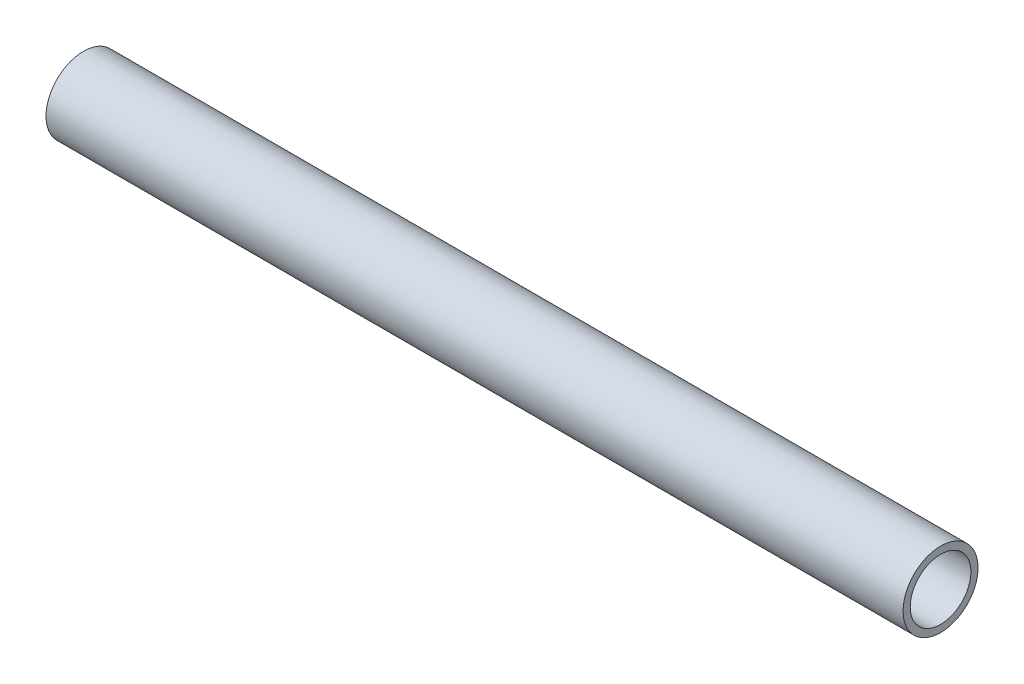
ISO-10303-21;
HEADER;
FILE_DESCRIPTION(('STEP AP214'),'2;1');
FILE_NAME('part.step','',(''),(''),'','','');
FILE_SCHEMA(('AUTOMOTIVE_DESIGN { 1 0 10303 214 1 1 1 1 }'));
ENDSEC;
DATA;
#1=APPLICATION_CONTEXT('core data for automotive mechanical design processes');
#2=APPLICATION_PROTOCOL_DEFINITION('international standard','automotive_design',2000,#1);
#3=PRODUCT_CONTEXT('',#1,'mechanical');
#4=PRODUCT('Part','Part','',(#3));
#5=PRODUCT_RELATED_PRODUCT_CATEGORY('part','',(#4));
#6=PRODUCT_DEFINITION_FORMATION('','',#4);
#7=PRODUCT_DEFINITION_CONTEXT('part definition',#1,'design');
#8=PRODUCT_DEFINITION('design','',#6,#7);
#9=PRODUCT_DEFINITION_SHAPE('','',#8);
#10=(LENGTH_UNIT() NAMED_UNIT(*) SI_UNIT(.MILLI.,.METRE.));
#11=(NAMED_UNIT(*) PLANE_ANGLE_UNIT() SI_UNIT($,.RADIAN.));
#12=(NAMED_UNIT(*) SI_UNIT($,.STERADIAN.) SOLID_ANGLE_UNIT());
#13=UNCERTAINTY_MEASURE_WITH_UNIT(LENGTH_MEASURE(1.E-05),#10,'distance_accuracy_value','');
#14=(GEOMETRIC_REPRESENTATION_CONTEXT(3) GLOBAL_UNCERTAINTY_ASSIGNED_CONTEXT((#13)) GLOBAL_UNIT_ASSIGNED_CONTEXT((#10,
#11,#12)) REPRESENTATION_CONTEXT('',''));
#15=CARTESIAN_POINT('',(0.,0.,0.));
#16=DIRECTION('',(0.,0.,1.));
#17=DIRECTION('',(1.,0.,0.));
#18=AXIS2_PLACEMENT_3D('',#15,#16,#17);
#19=CARTESIAN_POINT('',(-120.,10.5,0.));
#20=DIRECTION('',(1.,0.,0.));
#21=DIRECTION('',(0.,0.,-1.));
#22=AXIS2_PLACEMENT_3D('',#19,#20,#21);
#23=PLANE('',#22);
#24=CARTESIAN_POINT('',(-120.,0.,0.));
#25=DIRECTION('',(-1.,0.,0.));
#26=DIRECTION('',(0.,0.,1.));
#27=AXIS2_PLACEMENT_3D('',#24,#25,#26);
#28=CIRCLE('',#27,8.5);
#29=CARTESIAN_POINT('',(-120.,0.,8.5));
#30=VERTEX_POINT('',#29);
#31=EDGE_CURVE('E10',#30,#30,#28,.T.);
#32=ORIENTED_EDGE('',*,*,#31,.F.);
#33=EDGE_LOOP('',(#32));
#34=FACE_BOUND('',#33,.T.);
#35=CARTESIAN_POINT('',(-120.,0.,0.));
#36=DIRECTION('',(-1.,0.,0.));
#37=DIRECTION('',(0.,0.,1.));
#38=AXIS2_PLACEMENT_3D('',#35,#36,#37);
#39=CIRCLE('',#38,10.5);
#40=CARTESIAN_POINT('',(-120.,0.,10.5));
#41=VERTEX_POINT('',#40);
#42=EDGE_CURVE('E44',#41,#41,#39,.T.);
#43=ORIENTED_EDGE('',*,*,#42,.T.);
#44=EDGE_LOOP('',(#43));
#45=FACE_BOUND('',#44,.T.);
#46=ADVANCED_FACE('F30',(#34,#45),#23,.F.);
#47=CARTESIAN_POINT('',(-62.1158488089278,0.,0.));
#48=DIRECTION('',(-1.,0.,0.));
#49=DIRECTION('',(0.,0.,1.));
#50=AXIS2_PLACEMENT_3D('',#47,#48,#49);
#51=CYLINDRICAL_SURFACE('',#50,8.50000000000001);
#52=CARTESIAN_POINT('',(120.,0.,0.));
#53=DIRECTION('',(-1.,0.,0.));
#54=DIRECTION('',(0.,0.,1.));
#55=AXIS2_PLACEMENT_3D('',#52,#53,#54);
#56=CIRCLE('',#55,8.50000000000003);
#57=CARTESIAN_POINT('',(120.,0.,8.50000000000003));
#58=VERTEX_POINT('',#57);
#59=EDGE_CURVE('E36',#58,#58,#56,.T.);
#60=ORIENTED_EDGE('',*,*,#59,.F.);
#61=EDGE_LOOP('',(#60));
#62=FACE_BOUND('',#61,.T.);
#63=ORIENTED_EDGE('',*,*,#31,.T.);
#64=EDGE_LOOP('',(#63));
#65=FACE_BOUND('',#64,.T.);
#66=ADVANCED_FACE('F59',(#62,#65),#51,.F.);
#67=CARTESIAN_POINT('',(120.,10.5,0.));
#68=DIRECTION('',(-1.,0.,0.));
#69=DIRECTION('',(0.,0.,1.));
#70=AXIS2_PLACEMENT_3D('',#67,#68,#69);
#71=PLANE('',#70);
#72=CARTESIAN_POINT('',(120.,0.,0.));
#73=DIRECTION('',(-1.,0.,0.));
#74=DIRECTION('',(0.,0.,1.));
#75=AXIS2_PLACEMENT_3D('',#72,#73,#74);
#76=CIRCLE('',#75,10.5);
#77=CARTESIAN_POINT('',(120.,0.,10.5));
#78=VERTEX_POINT('',#77);
#79=EDGE_CURVE('E40',#78,#78,#76,.T.);
#80=ORIENTED_EDGE('',*,*,#79,.F.);
#81=EDGE_LOOP('',(#80));
#82=FACE_BOUND('',#81,.T.);
#83=ORIENTED_EDGE('',*,*,#59,.T.);
#84=EDGE_LOOP('',(#83));
#85=FACE_BOUND('',#84,.T.);
#86=ADVANCED_FACE('F54',(#82,#85),#71,.F.);
#87=CARTESIAN_POINT('',(-62.1158488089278,0.,0.));
#88=DIRECTION('',(-1.,0.,0.));
#89=DIRECTION('',(0.,0.,1.));
#90=AXIS2_PLACEMENT_3D('',#87,#88,#89);
#91=CYLINDRICAL_SURFACE('',#90,10.5);
#92=ORIENTED_EDGE('',*,*,#42,.F.);
#93=EDGE_LOOP('',(#92));
#94=FACE_BOUND('',#93,.T.);
#95=ORIENTED_EDGE('',*,*,#79,.T.);
#96=EDGE_LOOP('',(#95));
#97=FACE_BOUND('',#96,.T.);
#98=ADVANCED_FACE('F51',(#94,#97),#91,.T.);
#99=CLOSED_SHELL('',(#46,#66,#86,#98));
#100=MANIFOLD_SOLID_BREP('B2',#99);
#101=ADVANCED_BREP_SHAPE_REPRESENTATION('',(#18,#100),#14);
#102=SHAPE_DEFINITION_REPRESENTATION(#9,#101);
ENDSEC;
END-ISO-10303-21;
